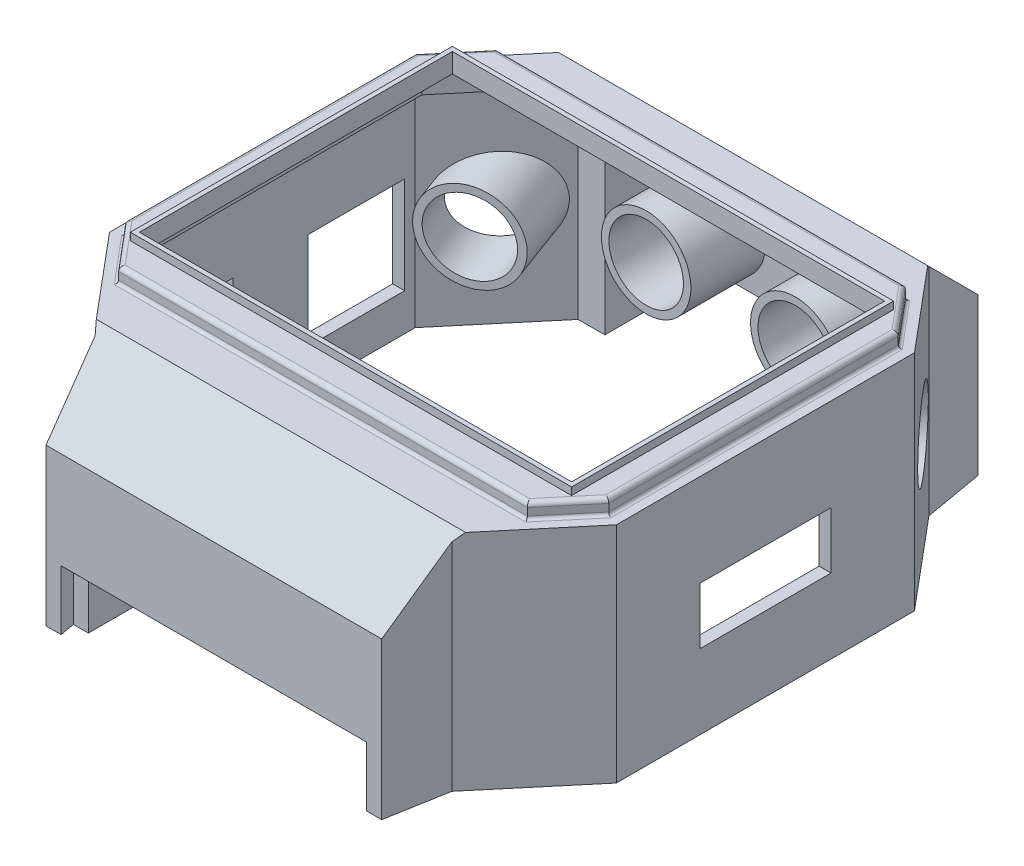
from build123d import *

# Parameters (mm, degrees)
EXTRUDE_1_DEPTH      = 17
SKETCH_3_W           = 29.6
SKETCH_3_H           = 21.6
CUT_EXTRUDE_3_DEPTH  = 1
CUT_EXTRUDE_4_DEPTH  = 1
FILLET_5_R           = 0.3
FILLET_6_R           = 0.2
CUT_EXTRUDE_5_REACH  = 44.953
CUT_EXTRUDE_6_REACH  = 33.273
SKETCH_7_W           = 29
SKETCH_7_H           = 21
CUT_EXTRUDE_7_DEPTH  = 12.5
CUT_EXTRUDE_8_DEPTH  = 1.5
CUT_EXTRUDE_9_DEPTH  = 1.2
EXTRUDE_2_DEPTH      = 12.5
CUT_EXTRUDE_10_DEPTH = 4
CUT_EXTRUDE_START    = -10.5
CUT_EXTRUDE_13_DEPTH = 10.5
CUT_EXTRUDE_14_DEPTH = 1.5
SKETCH_18_W          = 29.6
SKETCH_18_H          = 21.6
CUT_EXTRUDE_15_DEPTH = 0.5
EXTRUDE_3_DEPTH      = 10.5
CUT_EXTRUDE_16_REACH = 44.758
SKETCH_20_W          = 6.5
SKETCH_20_H          = 6.5
CUT_EXTRUDE_17_REACH = 44.758
SKETCH_21_W          = 8.8
SKETCH_21_H          = 3.8
SKETCH_24_R          = 3
EXTRUDE_4_DEPTH      = 6
CUT_EXTRUDE_18_REACH = 48.489
SKETCH_25_R          = 2.5
EXTRUDE_5_REACH      = 44.614
SKETCH_27_R          = 3
CUT_EXTRUDE_19_REACH = 44.614
SKETCH_30_R          = 2.5
EXTRUDE_6_REACH      = 44.614
SKETCH_31_R          = 3
SKETCH_31_R_2        = 2.5


with BuildPart() as part:
    # Sketch 1 → Extrude 1 (new body)
    with BuildSketch(Plane(origin=(0, 0, 0), x_dir=(1, 0, 0), z_dir=(0, 1, 0))):
        Polygon((-11.26009429, 20), (-11.965402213, 16), (-17, 10), (-17, -10), (-11.965402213, -16), (-11.26009429, -20), (11.26009429, -20), (11.965402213, -16), (17, -10), (17, 10), (11.965402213, 16), (11.26009429, 20), align=None)
    extrude(amount=EXTRUDE_1_DEPTH)

    # Sketch 3 → Cut-Extrude 3 (cut)
    with BuildSketch(Plane(origin=(0, 17, 0), x_dir=(1, 0, 0), z_dir=(0, 1, 0))):
        Polygon((-11.26009429, 20), (11.26009429, 20), (11.965402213, 16), (17, 10), (17, -10), (11.965402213, -16), (11.26009429, -20), (-11.26009429, -20), (-11.965402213, -16), (-17, -10), (-17, 10), (-11.965402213, 16), align=None)
        Rectangle(SKETCH_3_W, SKETCH_3_H, mode=Mode.SUBTRACT)
    extrude(amount=-CUT_EXTRUDE_3_DEPTH, mode=Mode.SUBTRACT)

    # Sketch 5 → Cut-Extrude 4 (cut)
    with BuildSketch(Plane(origin=(0, 16, 0), x_dir=(1, 0, 0), z_dir=(0, 1, 0))):
        Polygon((-11.26009429, 20), (11.26009429, 20), (11.965402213, 16), (17, 10), (17, -10), (11.965402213, -16), (11.26009429, -20), (-11.26009429, -20), (-11.965402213, -16), (-17, -10), (-17, 10), (-11.965402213, 16), align=None)
        Polygon((13.707389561, 12.679401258), (16.2, 9.708823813), (16.2, -9.708823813), (13.707389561, -12.679401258), (-13.707389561, -12.679401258), (-16.2, -9.708823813), (-16.2, 9.708823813), (-13.707389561, 12.679401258), align=None, mode=Mode.SUBTRACT)
    extrude(amount=-CUT_EXTRUDE_4_DEPTH, mode=Mode.SUBTRACT)

    # Fillet 5
    fillet_5_edges = [part.edges().sort_by_distance(p)[0] for p in [
        (16.2, 16, 0),
        (14.95369478, 16, 11.194112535),
        (0, 16, 12.679401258),
        (-14.95369478, 16, 11.194112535),
        (-16.2, 16, 0),
        (-14.95369478, 16, -11.194112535),
        (0, 16, -12.679401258),
        (14.95369478, 16, -11.194112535),
    ]]
    fillet(fillet_5_edges, radius=FILLET_5_R)

    # Fillet 6
    fillet_6_edges = [part.edges().sort_by_distance(p)[0] for p in [
        (16.2, 15, 0),
        (14.95369478, 15, -11.194112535),
        (0, 15, -12.679401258),
        (-14.95369478, 15, -11.194112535),
        (-16.2, 15, 0),
        (-14.95369478, 15, 11.194112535),
        (0, 15, 12.679401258),
        (14.95369478, 15, 11.194112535),
    ]]
    fillet(fillet_6_edges, radius=FILLET_6_R)

    # Sketch 6 → Cut-Extrude 5 (cut, up to next)
    with BuildSketch(Plane(origin=(17, 0, 0), x_dir=(0, 0, -1), z_dir=(1, 0, 0)), mode=Mode.PRIVATE) as cut_extrude_5_sk1:
        Polygon((-15.5, 15), (-20, 10.5), (-20, 15), align=None)
    cut_extrude_5_tool1 = extrude(cut_extrude_5_sk1.sketch, amount=-CUT_EXTRUDE_5_REACH, mode=Mode.PRIVATE) & part.part
    # Sketch 6 → Cut-Extrude 5 (cut, up to next)
    with BuildSketch(Plane(origin=(17, 0, 0), x_dir=(0, 0, -1), z_dir=(1, 0, 0)), mode=Mode.PRIVATE) as cut_extrude_5_sk2:
        Polygon((15.5, 15), (20, 10.5), (20, 15), align=None)
    cut_extrude_5_tool2 = extrude(cut_extrude_5_sk2.sketch, amount=-CUT_EXTRUDE_5_REACH, mode=Mode.PRIVATE) & part.part
    add(cut_extrude_5_tool1.solids().sort_by_distance((17, 13.5, 18.5))[0], mode=Mode.SUBTRACT)
    add(cut_extrude_5_tool2.solids().sort_by_distance((17, 13.5, -18.5))[0], mode=Mode.SUBTRACT)

    # Sketch 7 → Cut-Extrude 6 (cut, up to next)
    with BuildSketch(Plane(origin=(0, 17, 0), x_dir=(1, 0, 0), z_dir=(0, 1, 0)), mode=Mode.PRIVATE) as cut_extrude_6_sk1:
        Rectangle(SKETCH_7_W, SKETCH_7_H)
    cut_extrude_6_tool1 = extrude(cut_extrude_6_sk1.sketch, amount=-CUT_EXTRUDE_6_REACH, mode=Mode.PRIVATE) & part.part
    add(cut_extrude_6_tool1.solids().sort_by_distance((0, 17, 0))[0], mode=Mode.SUBTRACT)

    # Sketch 8 → Cut-Extrude 7 (cut)
    with BuildSketch(Plane.XZ):
        Polygon((10.952395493, -17.138030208), (-10.952395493, -17.138030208), (-11.214779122, -15.649978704), (-16.2, -9.708823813), (-16.2, 9.708823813), (-11.214779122, 15.649978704), (-10.969079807, 17.04340876), (10.969079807, 17.04340876), (11.214779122, 15.649978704), (16.2, 9.708823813), (16.2, -9.708823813), (11.214779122, -15.649978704), align=None)
    extrude(amount=-CUT_EXTRUDE_7_DEPTH, mode=Mode.SUBTRACT)

    # Sketch 9 → Cut-Extrude 8 (cut)
    with BuildSketch(Plane.XZ.offset(-12.5)):
        Polygon((-11.241224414, 15.5), (11.241224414, 15.5), (11.214779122, 15.649978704), (16.2, 9.708823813), (16.2, -9.708823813), (11.214779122, -15.649978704), (11.241224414, -15.5), (-11.241224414, -15.5), (-11.214779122, -15.649978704), (-16.2, -9.708823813), (-16.2, 9.708823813), (-11.214779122, 15.649978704), align=None)
    extrude(amount=-CUT_EXTRUDE_8_DEPTH, mode=Mode.SUBTRACT)

    # Sketch 11 → Cut-Extrude 9 (cut)
    with BuildSketch(Plane.XZ.offset(-14)):
        Polygon((-13.3809742, 11.979401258), (13.3809742, 11.979401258), (15.5, 9.454044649), (15.5, -9.454044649), (13.3809742, -11.979401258), (-13.3809742, -11.979401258), (-15.5, -9.454044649), (-15.5, 9.454044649), align=None)
    extrude(amount=-CUT_EXTRUDE_9_DEPTH, mode=Mode.SUBTRACT)

    # Sketch 12 → Extrude 2 (add)
    with BuildSketch(Plane.XZ.offset(-12.5)):
        Polygon((-11.214779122, -15.649978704), (-10.952395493, -17.138030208), (10.952395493, -17.138030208), (11.214779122, -15.649978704), align=None)
        Polygon((11.214779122, 15.649978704), (10.969079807, 17.04340876), (-10.969079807, 17.04340876), (-11.214779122, 15.649978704), align=None)
    extrude(amount=EXTRUDE_2_DEPTH)

    # Sketch 13 → Cut-Extrude 10 (cut)
    with BuildSketch(Plane.XZ):
        Polygon((-10.244667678, 20), (10.244667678, 20), (10.835366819, 16.649978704), (-10.835366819, 16.649978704), align=None)
    cut_extrude_10 = extrude(amount=-CUT_EXTRUDE_10_DEPTH, mode=Mode.SUBTRACT)

    # Mirror 1: Cut-Extrude 10 across plane
    add(cut_extrude_10.mirror(Plane.XY), mode=Mode.SUBTRACT)

    # Sketch 15 → Cut-Extrude 13 (cut)
    with BuildSketch(Plane.XZ.offset(CUT_EXTRUDE_START)):
        Polygon((-10.420994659, 19), (-11.214779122, 15.649978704), (11.214779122, 15.649978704), (10.420994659, 19), align=None)
    cut_extrude_13 = extrude(amount=CUT_EXTRUDE_13_DEPTH, mode=Mode.SUBTRACT)

    # Mirror 2: Cut-Extrude 13 across plane
    add(cut_extrude_13.mirror(Plane.XY), mode=Mode.SUBTRACT)

    # Sketch 16 → Cut-Extrude 14 (cut)
    with BuildSketch(Plane.XZ.offset(-12.5)):
        Polygon((-11.214779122, 15.649978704), (-11.241224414, 15.5), (11.241224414, 15.5), (11.214779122, 15.649978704), align=None)
        Polygon((-11.241224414, -15.5), (-11.214779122, -15.649978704), (11.214779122, -15.649978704), (11.241224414, -15.5), align=None)
    extrude(amount=-CUT_EXTRUDE_14_DEPTH, mode=Mode.SUBTRACT)

    # Sketch 18 → Cut-Extrude 15 (cut)
    with BuildSketch(Plane(origin=(0, 17, 0), x_dir=(1, 0, 0), z_dir=(0, 1, 0))):
        Rectangle(SKETCH_18_W, SKETCH_18_H)
    extrude(amount=-CUT_EXTRUDE_15_DEPTH, mode=Mode.SUBTRACT)

    # Sketch 19 → Extrude 3 (add)
    with BuildSketch(Plane.XZ.offset(-10.5)):
        Polygon((-9.420994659, 19), (-10.420994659, 19), (-11.214779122, 15.649978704), (-9.420994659, 15.649978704), align=None)
        Polygon((11.214779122, 15.649978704), (10.420994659, 19), (9.420994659, 19), (9.420994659, 15.649978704), align=None)
    extrude_3 = extrude(amount=EXTRUDE_3_DEPTH)

    # Mirror 3: Extrude 3 across plane
    add(extrude_3.mirror(Plane.XY))

    # Sketch 20 → Cut-Extrude 16 (cut, up to next)
    with BuildSketch(Plane.ZY.offset(17), mode=Mode.PRIVATE) as cut_extrude_16_sk1:
        with Locations((-5.75, 5.75)):
            Rectangle(SKETCH_20_W, SKETCH_20_H)
    cut_extrude_16_tool1 = extrude(cut_extrude_16_sk1.sketch, amount=-CUT_EXTRUDE_16_REACH, mode=Mode.PRIVATE) & part.part
    # Sketch 20 → Cut-Extrude 16 (cut, up to next)
    with BuildSketch(Plane.ZY.offset(17), mode=Mode.PRIVATE) as cut_extrude_16_sk2:
        with Locations((5.75, 5.75)):
            Rectangle(SKETCH_20_W, SKETCH_20_H)
    cut_extrude_16_tool2 = extrude(cut_extrude_16_sk2.sketch, amount=-CUT_EXTRUDE_16_REACH, mode=Mode.PRIVATE) & part.part
    add(cut_extrude_16_tool1.solids().sort_by_distance((-17, 5.75, -5.75))[0], mode=Mode.SUBTRACT)
    add(cut_extrude_16_tool2.solids().sort_by_distance((-17, 5.75, 5.75))[0], mode=Mode.SUBTRACT)

    # Sketch 21 → Cut-Extrude 17 (cut, up to next)
    with BuildSketch(Plane(origin=(17, 0, 0), x_dir=(0, 0, -1), z_dir=(1, 0, 0)), mode=Mode.PRIVATE) as cut_extrude_17_sk1:
        with Locations((0, 6.9)):
            Rectangle(SKETCH_21_W, SKETCH_21_H)
    cut_extrude_17_tool1 = extrude(cut_extrude_17_sk1.sketch, amount=-CUT_EXTRUDE_17_REACH, mode=Mode.PRIVATE) & part.part
    add(cut_extrude_17_tool1.solids().sort_by_distance((17, 6.9, 0))[0], mode=Mode.SUBTRACT)

    # Sketch 24 → Extrude 4 (add)
    with BuildSketch(Plane(origin=(0, 0, -20), x_dir=(-1, 0, 0), z_dir=(0, 0, -1))):
        with Locations((-5, 7.25)):
            Circle(SKETCH_24_R)
        with Locations((5, 7.25)):
            Circle(SKETCH_24_R)
    extrude(amount=-EXTRUDE_4_DEPTH)

    # Sketch 25 → Cut-Extrude 18 (cut, up to next)
    with BuildSketch(Plane(origin=(0, 0, -20), x_dir=(-1, 0, 0), z_dir=(0, 0, -1)), mode=Mode.PRIVATE) as cut_extrude_18_sk1:
        with Locations((-5, 7.25)):
            Circle(SKETCH_25_R)
    cut_extrude_18_tool1 = extrude(cut_extrude_18_sk1.sketch, amount=-CUT_EXTRUDE_18_REACH, mode=Mode.PRIVATE) & part.part
    # Sketch 25 → Cut-Extrude 18 (cut, up to next)
    with BuildSketch(Plane(origin=(0, 0, -20), x_dir=(-1, 0, 0), z_dir=(0, 0, -1)), mode=Mode.PRIVATE) as cut_extrude_18_sk2:
        with Locations((5, 7.25)):
            Circle(SKETCH_25_R)
    cut_extrude_18_tool2 = extrude(cut_extrude_18_sk2.sketch, amount=-CUT_EXTRUDE_18_REACH, mode=Mode.PRIVATE) & part.part
    add(cut_extrude_18_tool1.solids().sort_by_distance((5, 7.25, -20))[0], mode=Mode.SUBTRACT)
    add(cut_extrude_18_tool2.solids().sort_by_distance((-5, 7.25, -20))[0], mode=Mode.SUBTRACT)

    # Extrude 5: up to this plane
    extrude_5_end = Plane(origin=(-16.2, 62.097035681, -9.708823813), z_dir=(-0.7660444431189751, 0, -0.6427876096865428))
    # Sketch 27 → Extrude 5 (add, up to the surface)
    with BuildSketch(Plane(origin=(-4.676216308, 0.148664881, -12.843704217), x_dir=(-0.013981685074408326, 0.9997634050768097, 0.01666272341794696), z_dir=(0.3420961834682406, -0.010875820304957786, 0.939601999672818)), mode=Mode.PRIVATE) as extrude_5_sk1:
        with Locations(Location((6.978722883, 8.412444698, 0), (0, 0, 268.920564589))):
            Circle(SKETCH_27_R)
    extrude_5_tool1 = split(extrude(extrude_5_sk1.sketch, amount=-EXTRUDE_5_REACH, mode=Mode.PRIVATE), bisect_by=extrude_5_end, keep=Keep.BOTH, mode=Mode.PRIVATE)
    add(extrude_5_tool1.solids().sort_by_distance((-12.677795, 6.967267, -9.851515))[0])

    # Cut-Extrude 19: up to this plane
    cut_extrude_19_end = Plane(origin=(-11.965402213, 17, -16), z_dir=(0.7660444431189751, 0, 0.6427876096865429))
    # Sketch 30 → Cut-Extrude 19 (cut, up to the surface)
    with BuildSketch(Plane(origin=(-4.676216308, 0.148664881, -12.843704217), x_dir=(-0.013981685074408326, 0.9997634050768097, 0.01666272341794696), z_dir=(0.3420961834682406, -0.010875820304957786, 0.939601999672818)), mode=Mode.PRIVATE) as cut_extrude_19_sk1:
        with Locations(Location((6.978722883, 8.412444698, 0), (0, 0, 268.920564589))):
            Circle(SKETCH_30_R)
    cut_extrude_19_tool1 = split(extrude(cut_extrude_19_sk1.sketch, amount=-CUT_EXTRUDE_19_REACH, mode=Mode.PRIVATE), bisect_by=cut_extrude_19_end, keep=Keep.BOTH, mode=Mode.PRIVATE)
    cut_extrude_19 = cut_extrude_19_tool1.solids().sort_by_distance((-12.677795, 6.967267, -9.851515))[0]
    add(cut_extrude_19, mode=Mode.SUBTRACT)

    # Mirror 4: Cut-Extrude 19 across plane
    add(cut_extrude_19.mirror(Plane(origin=(0, 0, 0), x_dir=(0, 0, 1), z_dir=(1, 0, 0))), mode=Mode.SUBTRACT)

    # Extrude 6: up to this plane
    extrude_6_end = Plane(origin=(11.214779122, 62.097035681, -15.649978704), z_dir=(0.7660444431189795, 0, -0.6427876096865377))
    # Sketch 31 → Extrude 6 (add, up to the surface)
    with BuildSketch(Plane(origin=(4.676216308, 0.148664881, -12.843704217), x_dir=(0.013981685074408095, 0.9997634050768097, 0.016662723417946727), z_dir=(0.34209618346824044, 0.010875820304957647, -0.939601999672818)), mode=Mode.PRIVATE) as extrude_6_sk1:
        with Locations(Location((6.978722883, 8.412444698, 0), (0, 0, 90))):
            Circle(SKETCH_31_R)
        with Locations(Location((6.978722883, 8.412444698, 0), (0, 0, 90))):
            Circle(SKETCH_31_R_2, mode=Mode.SUBTRACT)
    extrude_6_tool1 = split(extrude(extrude_6_sk1.sketch, amount=EXTRUDE_6_REACH, mode=Mode.PRIVATE), bisect_by=extrude_6_end, keep=Keep.BOTH, mode=Mode.PRIVATE)
    add(extrude_6_tool1.solids().sort_by_distance((9.938836, 7.022181, -10.848096))[0])


solid = part.part
